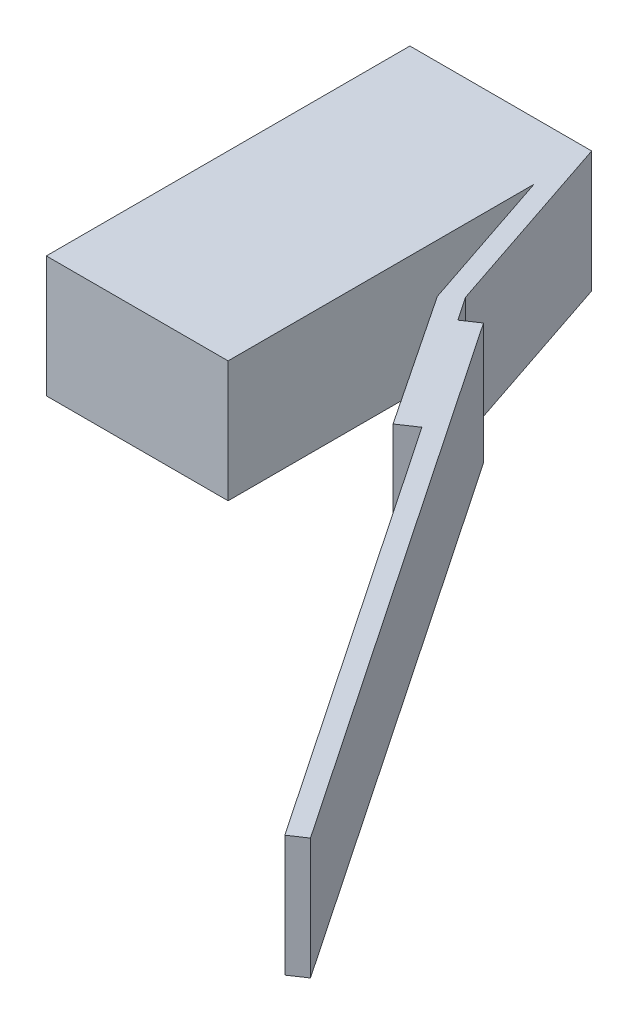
from build123d import *

# Parameters (mm, degrees)
EXTRUDE1_DEPTH = 6.35


with BuildPart() as part:
    # Sketch1 → Extrude1 (new body)
    with BuildSketch(Plane(origin=(0, 0, 0), x_dir=(1, 0, 0), z_dir=(0, 1, 0))):
        Polygon((0, 0), (0, 19.05), (9.525, 19.05), (12.856152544, 9.112973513), (13.696644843, 7.867921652), (14.498255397, 8.409061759), (33.335606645, -19.49539288), (32.533996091, -20.036532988), (17.61285945, 2.066690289), (16.710211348, 1.457343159), (12.079156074, 8.409061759), (9.525, 16.028261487), (9.525, 0), align=None)
    extrude(amount=EXTRUDE1_DEPTH)


solid = part.part
